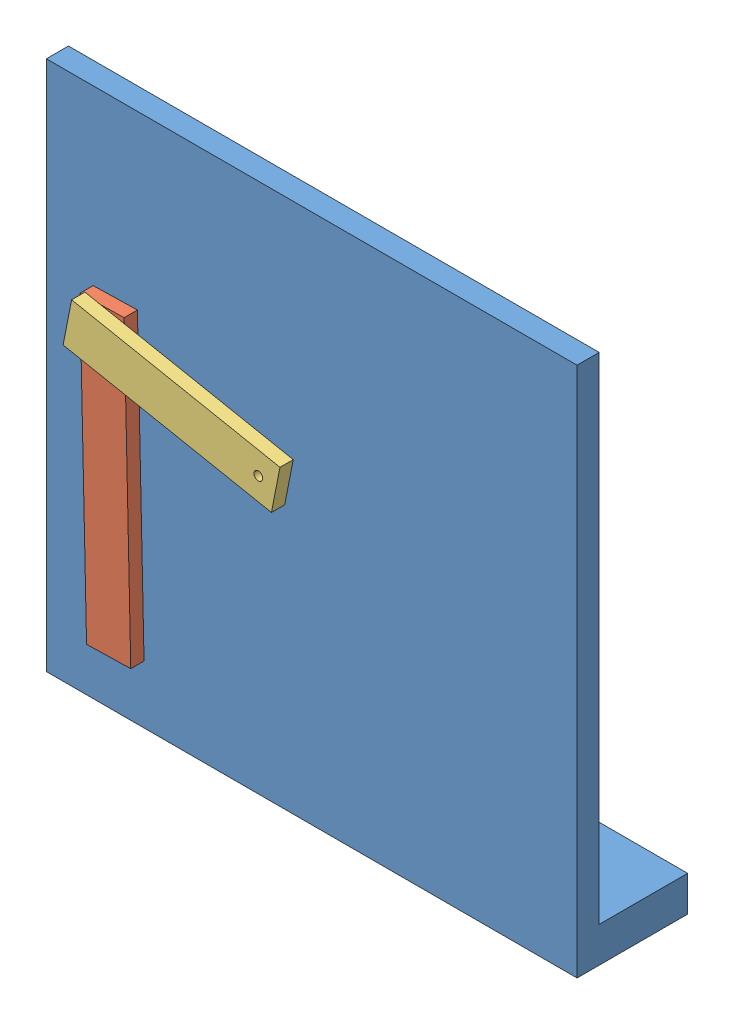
SolidWorks assembly P2Rmech.SLDASM, configuration ﾃﾞﾌｫﾙﾄ (file format 4400). Lengths in mm.
Overall size (1200 1200 330).
3 component instances, 3 part files, 4 mates.
Components (placement in the parent):
- Base-1: Base.SLDPRT [ﾃﾞﾌｫﾙﾄ] at (-570.4236 -88.3275 125) size (1200 1200 250)
- Link1-1: Link1.SLDPRT [ﾃﾞﾌｫﾙﾄ] at (-439.5307 50.5812 165) x (-0.022019 0.999758 0) z (0 0 -1) size (680 100 80)
- Link2-1: Link2.SLDPRT [ﾃﾞﾌｫﾙﾄ] at (-433.2556 748.2951 205) x (0.981276 -0.192608 0) z (0 0 -1) size (480 100 80)
Mates (geometry in assembly coordinates):
- 同心円1: concentric aligned: cylinder of Link1-1 through (-390.4236 91.6725 85) axis (0 0 1) radius 25; cylinder of Base-1 through (-390.4236 91.6725 -125) axis (0 0 1) radius 25
- 一致1: coincident anti-aligned: plane of Base-1 through (-570.4236 1111.6725 125) normal (0 0 1); plane of Link1-1 through (-390.4236 91.6725 125) normal (0 0 -1)
- 同心円2: concentric anti-aligned: cylinder of Link2-1 through (-403.6349 691.527 125) axis (0 0 1) radius 25; cylinder of Link1-1 through (-403.6349 691.527 165) axis (0 0 -1) radius 25
- 一致2: coincident anti-aligned: plane of Link1-1 through (-339.5549 52.7831 165) normal (0 0 1); plane of Link2-1 through (-403.6349 691.527 165) normal (0 0 -1)
